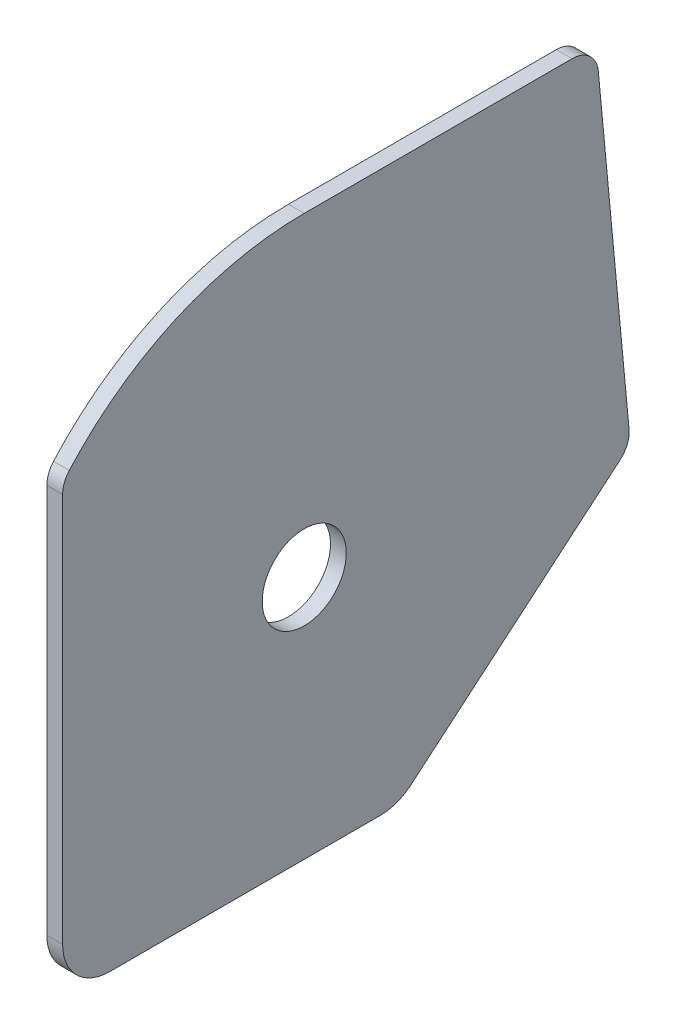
ISO-10303-21;
HEADER;
FILE_DESCRIPTION(('STEP AP214'),'2;1');
FILE_NAME('part.step','',(''),(''),'','','');
FILE_SCHEMA(('AUTOMOTIVE_DESIGN { 1 0 10303 214 1 1 1 1 }'));
ENDSEC;
DATA;
#1=APPLICATION_CONTEXT('core data for automotive mechanical design processes');
#2=APPLICATION_PROTOCOL_DEFINITION('international standard','automotive_design',2000,#1);
#3=PRODUCT_CONTEXT('',#1,'mechanical');
#4=PRODUCT('Part','Part','',(#3));
#5=PRODUCT_RELATED_PRODUCT_CATEGORY('part','',(#4));
#6=PRODUCT_DEFINITION_FORMATION('','',#4);
#7=PRODUCT_DEFINITION_CONTEXT('part definition',#1,'design');
#8=PRODUCT_DEFINITION('design','',#6,#7);
#9=PRODUCT_DEFINITION_SHAPE('','',#8);
#10=(LENGTH_UNIT() NAMED_UNIT(*) SI_UNIT(.MILLI.,.METRE.));
#11=(NAMED_UNIT(*) PLANE_ANGLE_UNIT() SI_UNIT($,.RADIAN.));
#12=(NAMED_UNIT(*) SI_UNIT($,.STERADIAN.) SOLID_ANGLE_UNIT());
#13=UNCERTAINTY_MEASURE_WITH_UNIT(LENGTH_MEASURE(1.E-05),#10,'distance_accuracy_value','');
#14=(GEOMETRIC_REPRESENTATION_CONTEXT(3) GLOBAL_UNCERTAINTY_ASSIGNED_CONTEXT((#13)) GLOBAL_UNIT_ASSIGNED_CONTEXT((#10,
#11,#12)) REPRESENTATION_CONTEXT('',''));
#15=CARTESIAN_POINT('',(0.,0.,0.));
#16=DIRECTION('',(0.,0.,1.));
#17=DIRECTION('',(1.,0.,0.));
#18=AXIS2_PLACEMENT_3D('',#15,#16,#17);
#19=CARTESIAN_POINT('',(3.,0.,0.));
#20=DIRECTION('',(1.,0.,0.));
#21=DIRECTION('',(0.,0.,-1.));
#22=AXIS2_PLACEMENT_3D('',#19,#20,#21);
#23=PLANE('',#22);
#24=CARTESIAN_POINT('',(3.,0.,0.));
#25=DIRECTION('',(1.,0.,0.));
#26=DIRECTION('',(0.,0.,-1.));
#27=AXIS2_PLACEMENT_3D('',#24,#25,#26);
#28=CIRCLE('',#27,60.);
#29=CARTESIAN_POINT('',(3.,60.,0.));
#30=VERTEX_POINT('',#29);
#31=CARTESIAN_POINT('',(3.,39.9933878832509,44.7272727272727));
#32=VERTEX_POINT('',#31);
#33=EDGE_CURVE('E156',#30,#32,#28,.T.);
#34=ORIENTED_EDGE('',*,*,#33,.T.);
#35=CARTESIAN_POINT('',(3.,36.6606055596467,41.));
#36=DIRECTION('',(1.,0.,0.));
#37=DIRECTION('',(0.,0.,-1.));
#38=AXIS2_PLACEMENT_3D('',#35,#36,#37);
#39=CIRCLE('',#38,4.99999999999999);
#40=CARTESIAN_POINT('',(3.,36.6606055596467,46.));
#41=VERTEX_POINT('',#40);
#42=EDGE_CURVE('E127',#32,#41,#39,.T.);
#43=ORIENTED_EDGE('',*,*,#42,.T.);
#44=DIRECTION('',(0.,-1.,0.));
#45=VECTOR('',#44,1.);
#46=CARTESIAN_POINT('',(3.,36.6606055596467,46.));
#47=LINE('',#46,#45);
#48=CARTESIAN_POINT('',(3.,-37.4999999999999,46.));
#49=VERTEX_POINT('',#48);
#50=EDGE_CURVE('E159',#41,#49,#47,.T.);
#51=ORIENTED_EDGE('',*,*,#50,.T.);
#52=CARTESIAN_POINT('',(3.,-37.5,37.));
#53=DIRECTION('',(1.,0.,0.));
#54=DIRECTION('',(0.,0.,1.));
#55=AXIS2_PLACEMENT_3D('',#52,#53,#54);
#56=CIRCLE('',#55,9.);
#57=CARTESIAN_POINT('',(3.,-46.5,36.9999999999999));
#58=VERTEX_POINT('',#57);
#59=EDGE_CURVE('E161',#49,#58,#56,.T.);
#60=ORIENTED_EDGE('',*,*,#59,.T.);
#61=DIRECTION('',(0.,0.,-1.));
#62=VECTOR('',#61,1.);
#63=CARTESIAN_POINT('',(3.,-46.5,36.9999999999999));
#64=LINE('',#63,#62);
#65=CARTESIAN_POINT('',(3.,-46.5,-14.5));
#66=VERTEX_POINT('',#65);
#67=EDGE_CURVE('E163',#58,#66,#64,.T.);
#68=ORIENTED_EDGE('',*,*,#67,.T.);
#69=CARTESIAN_POINT('',(3.,-37.5,-14.5));
#70=DIRECTION('',(1.,0.,0.));
#71=DIRECTION('',(0.,0.,1.));
#72=AXIS2_PLACEMENT_3D('',#69,#70,#71);
#73=CIRCLE('',#72,8.99999999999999);
#74=CARTESIAN_POINT('',(3.,-44.3741642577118,-20.3091191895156));
#75=VERTEX_POINT('',#74);
#76=EDGE_CURVE('E165',#66,#75,#73,.T.);
#77=ORIENTED_EDGE('',*,*,#76,.T.);
#78=DIRECTION('',(0.,0.645457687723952,-0.76379602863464));
#79=VECTOR('',#78,1.);
#80=CARTESIAN_POINT('',(3.,-44.3741642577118,-20.3091191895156));
#81=LINE('',#80,#79);
#82=CARTESIAN_POINT('',(3.,-10.7628737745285,-60.0827103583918));
#83=VERTEX_POINT('',#82);
#84=EDGE_CURVE('E167',#75,#83,#81,.T.);
#85=ORIENTED_EDGE('',*,*,#84,.T.);
#86=CARTESIAN_POINT('',(3.,-6.94389363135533,-56.855421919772));
#87=DIRECTION('',(1.,0.,0.));
#88=DIRECTION('',(0.,0.,-1.));
#89=AXIS2_PLACEMENT_3D('',#86,#87,#88);
#90=CIRCLE('',#89,5.);
#91=CARTESIAN_POINT('',(3.,-6.47335206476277,-61.8332317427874));
#92=VERTEX_POINT('',#91);
#93=EDGE_CURVE('E169',#83,#92,#90,.T.);
#94=ORIENTED_EDGE('',*,*,#93,.T.);
#95=DIRECTION('',(0.,0.99556196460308,0.0941083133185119));
#96=VECTOR('',#95,1.);
#97=CARTESIAN_POINT('',(3.,-6.47335206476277,-61.8332317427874));
#98=LINE('',#97,#96);
#99=CARTESIAN_POINT('',(3.,55.4705415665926,-55.9778098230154));
#100=VERTEX_POINT('',#99);
#101=EDGE_CURVE('E171',#92,#100,#98,.T.);
#102=ORIENTED_EDGE('',*,*,#101,.T.);
#103=CARTESIAN_POINT('',(3.,55.,-51.));
#104=DIRECTION('',(1.,0.,0.));
#105=DIRECTION('',(0.,0.,-1.));
#106=AXIS2_PLACEMENT_3D('',#103,#104,#105);
#107=CIRCLE('',#106,5.);
#108=CARTESIAN_POINT('',(3.,60.,-51.));
#109=VERTEX_POINT('',#108);
#110=EDGE_CURVE('E50',#100,#109,#107,.T.);
#111=ORIENTED_EDGE('',*,*,#110,.T.);
#112=DIRECTION('',(0.,0.,1.));
#113=VECTOR('',#112,1.);
#114=CARTESIAN_POINT('',(3.,60.,-51.));
#115=LINE('',#114,#113);
#116=EDGE_CURVE('E45',#109,#30,#115,.T.);
#117=ORIENTED_EDGE('',*,*,#116,.T.);
#118=EDGE_LOOP('',(#34,#43,#51,#60,#68,#77,#85,#94,#102,#111,#117));
#119=FACE_BOUND('',#118,.T.);
#120=CARTESIAN_POINT('',(3.,0.,0.));
#121=DIRECTION('',(1.,0.,0.));
#122=DIRECTION('',(0.,0.,-1.));
#123=AXIS2_PLACEMENT_3D('',#120,#121,#122);
#124=CIRCLE('',#123,8.);
#125=CARTESIAN_POINT('',(3.,0.,-8.));
#126=VERTEX_POINT('',#125);
#127=EDGE_CURVE('E132',#126,#126,#124,.T.);
#128=ORIENTED_EDGE('',*,*,#127,.F.);
#129=EDGE_LOOP('',(#128));
#130=FACE_BOUND('',#129,.T.);
#131=ADVANCED_FACE('F30',(#119,#130),#23,.T.);
#132=CARTESIAN_POINT('',(0.,0.,0.));
#133=DIRECTION('',(1.,0.,0.));
#134=DIRECTION('',(0.,0.,-1.));
#135=AXIS2_PLACEMENT_3D('',#132,#133,#134);
#136=PLANE('',#135);
#137=CARTESIAN_POINT('',(0.,0.,0.));
#138=DIRECTION('',(1.,0.,0.));
#139=DIRECTION('',(0.,0.,-1.));
#140=AXIS2_PLACEMENT_3D('',#137,#138,#139);
#141=CIRCLE('',#140,60.);
#142=CARTESIAN_POINT('',(0.,60.,0.));
#143=VERTEX_POINT('',#142);
#144=CARTESIAN_POINT('',(0.,39.9933878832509,44.7272727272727));
#145=VERTEX_POINT('',#144);
#146=EDGE_CURVE('E118',#143,#145,#141,.T.);
#147=ORIENTED_EDGE('',*,*,#146,.F.);
#148=DIRECTION('',(0.,0.,1.));
#149=VECTOR('',#148,1.);
#150=CARTESIAN_POINT('',(0.,60.,-51.));
#151=LINE('',#150,#149);
#152=CARTESIAN_POINT('',(0.,60.,-51.));
#153=VERTEX_POINT('',#152);
#154=EDGE_CURVE('E154',#153,#143,#151,.T.);
#155=ORIENTED_EDGE('',*,*,#154,.F.);
#156=CARTESIAN_POINT('',(0.,55.,-51.));
#157=DIRECTION('',(1.,0.,0.));
#158=DIRECTION('',(0.,0.,-1.));
#159=AXIS2_PLACEMENT_3D('',#156,#157,#158);
#160=CIRCLE('',#159,5.);
#161=CARTESIAN_POINT('',(0.,55.4705415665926,-55.9778098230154));
#162=VERTEX_POINT('',#161);
#163=EDGE_CURVE('E152',#162,#153,#160,.T.);
#164=ORIENTED_EDGE('',*,*,#163,.F.);
#165=DIRECTION('',(0.,0.99556196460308,0.0941083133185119));
#166=VECTOR('',#165,1.);
#167=CARTESIAN_POINT('',(0.,-6.47335206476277,-61.8332317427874));
#168=LINE('',#167,#166);
#169=CARTESIAN_POINT('',(0.,-6.47335206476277,-61.8332317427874));
#170=VERTEX_POINT('',#169);
#171=EDGE_CURVE('E150',#170,#162,#168,.T.);
#172=ORIENTED_EDGE('',*,*,#171,.F.);
#173=CARTESIAN_POINT('',(0.,-6.94389363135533,-56.855421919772));
#174=DIRECTION('',(1.,0.,0.));
#175=DIRECTION('',(0.,0.,-1.));
#176=AXIS2_PLACEMENT_3D('',#173,#174,#175);
#177=CIRCLE('',#176,5.);
#178=CARTESIAN_POINT('',(0.,-10.7628737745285,-60.0827103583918));
#179=VERTEX_POINT('',#178);
#180=EDGE_CURVE('E148',#179,#170,#177,.T.);
#181=ORIENTED_EDGE('',*,*,#180,.F.);
#182=DIRECTION('',(0.,0.645457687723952,-0.76379602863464));
#183=VECTOR('',#182,1.);
#184=CARTESIAN_POINT('',(0.,-44.3741642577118,-20.3091191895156));
#185=LINE('',#184,#183);
#186=CARTESIAN_POINT('',(0.,-44.3741642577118,-20.3091191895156));
#187=VERTEX_POINT('',#186);
#188=EDGE_CURVE('E146',#187,#179,#185,.T.);
#189=ORIENTED_EDGE('',*,*,#188,.F.);
#190=CARTESIAN_POINT('',(0.,-37.5,-14.5));
#191=DIRECTION('',(1.,0.,0.));
#192=DIRECTION('',(0.,0.,1.));
#193=AXIS2_PLACEMENT_3D('',#190,#191,#192);
#194=CIRCLE('',#193,8.99999999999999);
#195=CARTESIAN_POINT('',(0.,-46.5,-14.5));
#196=VERTEX_POINT('',#195);
#197=EDGE_CURVE('E144',#196,#187,#194,.T.);
#198=ORIENTED_EDGE('',*,*,#197,.F.);
#199=DIRECTION('',(0.,0.,-1.));
#200=VECTOR('',#199,1.);
#201=CARTESIAN_POINT('',(0.,-46.5,36.9999999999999));
#202=LINE('',#201,#200);
#203=CARTESIAN_POINT('',(0.,-46.5,36.9999999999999));
#204=VERTEX_POINT('',#203);
#205=EDGE_CURVE('E142',#204,#196,#202,.T.);
#206=ORIENTED_EDGE('',*,*,#205,.F.);
#207=CARTESIAN_POINT('',(0.,-37.5,37.));
#208=DIRECTION('',(1.,0.,0.));
#209=DIRECTION('',(0.,0.,1.));
#210=AXIS2_PLACEMENT_3D('',#207,#208,#209);
#211=CIRCLE('',#210,9.);
#212=CARTESIAN_POINT('',(0.,-37.4999999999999,46.));
#213=VERTEX_POINT('',#212);
#214=EDGE_CURVE('E140',#213,#204,#211,.T.);
#215=ORIENTED_EDGE('',*,*,#214,.F.);
#216=DIRECTION('',(0.,-1.,0.));
#217=VECTOR('',#216,1.);
#218=CARTESIAN_POINT('',(0.,36.6606055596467,46.));
#219=LINE('',#218,#217);
#220=CARTESIAN_POINT('',(0.,36.6606055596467,46.));
#221=VERTEX_POINT('',#220);
#222=EDGE_CURVE('E120',#221,#213,#219,.T.);
#223=ORIENTED_EDGE('',*,*,#222,.F.);
#224=CARTESIAN_POINT('',(0.,36.6606055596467,41.));
#225=DIRECTION('',(1.,0.,0.));
#226=DIRECTION('',(0.,0.,-1.));
#227=AXIS2_PLACEMENT_3D('',#224,#225,#226);
#228=CIRCLE('',#227,4.99999999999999);
#229=EDGE_CURVE('E113',#145,#221,#228,.T.);
#230=ORIENTED_EDGE('',*,*,#229,.F.);
#231=EDGE_LOOP('',(#147,#155,#164,#172,#181,#189,#198,#206,#215,#223,#230));
#232=FACE_BOUND('',#231,.T.);
#233=CARTESIAN_POINT('',(0.,0.,0.));
#234=DIRECTION('',(1.,0.,0.));
#235=DIRECTION('',(0.,0.,-1.));
#236=AXIS2_PLACEMENT_3D('',#233,#234,#235);
#237=CIRCLE('',#236,8.);
#238=CARTESIAN_POINT('',(0.,0.,-8.));
#239=VERTEX_POINT('',#238);
#240=EDGE_CURVE('E135',#239,#239,#237,.T.);
#241=ORIENTED_EDGE('',*,*,#240,.T.);
#242=EDGE_LOOP('',(#241));
#243=FACE_BOUND('',#242,.T.);
#244=ADVANCED_FACE('F114',(#232,#243),#136,.F.);
#245=CARTESIAN_POINT('',(3.,0.,0.));
#246=DIRECTION('',(-1.,0.,0.));
#247=DIRECTION('',(0.,0.,1.));
#248=AXIS2_PLACEMENT_3D('',#245,#246,#247);
#249=CYLINDRICAL_SURFACE('',#248,60.);
#250=ORIENTED_EDGE('',*,*,#146,.T.);
#251=DIRECTION('',(-1.,0.,0.));
#252=VECTOR('',#251,1.);
#253=CARTESIAN_POINT('',(3.,39.9933878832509,44.7272727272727));
#254=LINE('',#253,#252);
#255=EDGE_CURVE('E11',#32,#145,#254,.T.);
#256=ORIENTED_EDGE('',*,*,#255,.F.);
#257=ORIENTED_EDGE('',*,*,#33,.F.);
#258=DIRECTION('',(-1.,0.,0.));
#259=VECTOR('',#258,1.);
#260=CARTESIAN_POINT('',(3.,60.,0.));
#261=LINE('',#260,#259);
#262=EDGE_CURVE('E131',#30,#143,#261,.T.);
#263=ORIENTED_EDGE('',*,*,#262,.T.);
#264=EDGE_LOOP('',(#250,#256,#257,#263));
#265=FACE_BOUND('',#264,.T.);
#266=ADVANCED_FACE('F32',(#265),#249,.T.);
#267=CARTESIAN_POINT('',(3.,36.6606055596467,41.));
#268=DIRECTION('',(-1.,0.,0.));
#269=DIRECTION('',(0.,0.,1.));
#270=AXIS2_PLACEMENT_3D('',#267,#268,#269);
#271=CYLINDRICAL_SURFACE('',#270,4.99999999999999);
#272=ORIENTED_EDGE('',*,*,#229,.T.);
#273=DIRECTION('',(-1.,0.,0.));
#274=VECTOR('',#273,1.);
#275=CARTESIAN_POINT('',(3.,36.6606055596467,46.));
#276=LINE('',#275,#274);
#277=EDGE_CURVE('E38',#41,#221,#276,.T.);
#278=ORIENTED_EDGE('',*,*,#277,.F.);
#279=ORIENTED_EDGE('',*,*,#42,.F.);
#280=ORIENTED_EDGE('',*,*,#255,.T.);
#281=EDGE_LOOP('',(#272,#278,#279,#280));
#282=FACE_BOUND('',#281,.T.);
#283=ADVANCED_FACE('F126',(#282),#271,.T.);
#284=CARTESIAN_POINT('',(3.,36.6606055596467,46.));
#285=DIRECTION('',(0.,0.,-1.));
#286=DIRECTION('',(0.,1.,0.));
#287=AXIS2_PLACEMENT_3D('',#284,#285,#286);
#288=PLANE('',#287);
#289=ORIENTED_EDGE('',*,*,#222,.T.);
#290=DIRECTION('',(-1.,0.,0.));
#291=VECTOR('',#290,1.);
#292=CARTESIAN_POINT('',(3.,-37.4999999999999,46.));
#293=LINE('',#292,#291);
#294=EDGE_CURVE('E197',#49,#213,#293,.T.);
#295=ORIENTED_EDGE('',*,*,#294,.F.);
#296=ORIENTED_EDGE('',*,*,#50,.F.);
#297=ORIENTED_EDGE('',*,*,#277,.T.);
#298=EDGE_LOOP('',(#289,#295,#296,#297));
#299=FACE_BOUND('',#298,.T.);
#300=ADVANCED_FACE('F201',(#299),#288,.F.);
#301=CARTESIAN_POINT('',(3.,-37.5,37.));
#302=DIRECTION('',(-1.,0.,0.));
#303=DIRECTION('',(0.,0.,1.));
#304=AXIS2_PLACEMENT_3D('',#301,#302,#303);
#305=CYLINDRICAL_SURFACE('',#304,9.);
#306=ORIENTED_EDGE('',*,*,#214,.T.);
#307=DIRECTION('',(-1.,0.,0.));
#308=VECTOR('',#307,1.);
#309=CARTESIAN_POINT('',(3.,-46.5,36.9999999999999));
#310=LINE('',#309,#308);
#311=EDGE_CURVE('E194',#58,#204,#310,.T.);
#312=ORIENTED_EDGE('',*,*,#311,.F.);
#313=ORIENTED_EDGE('',*,*,#59,.F.);
#314=ORIENTED_EDGE('',*,*,#294,.T.);
#315=EDGE_LOOP('',(#306,#312,#313,#314));
#316=FACE_BOUND('',#315,.T.);
#317=ADVANCED_FACE('F209',(#316),#305,.T.);
#318=CARTESIAN_POINT('',(3.,-46.5,36.9999999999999));
#319=DIRECTION('',(0.,1.,0.));
#320=DIRECTION('',(0.,0.,1.));
#321=AXIS2_PLACEMENT_3D('',#318,#319,#320);
#322=PLANE('',#321);
#323=ORIENTED_EDGE('',*,*,#205,.T.);
#324=DIRECTION('',(-1.,0.,0.));
#325=VECTOR('',#324,1.);
#326=CARTESIAN_POINT('',(3.,-46.5,-14.5));
#327=LINE('',#326,#325);
#328=EDGE_CURVE('E191',#66,#196,#327,.T.);
#329=ORIENTED_EDGE('',*,*,#328,.F.);
#330=ORIENTED_EDGE('',*,*,#67,.F.);
#331=ORIENTED_EDGE('',*,*,#311,.T.);
#332=EDGE_LOOP('',(#323,#329,#330,#331));
#333=FACE_BOUND('',#332,.T.);
#334=ADVANCED_FACE('F212',(#333),#322,.F.);
#335=CARTESIAN_POINT('',(3.,-37.5,-14.5));
#336=DIRECTION('',(-1.,0.,0.));
#337=DIRECTION('',(0.,0.,1.));
#338=AXIS2_PLACEMENT_3D('',#335,#336,#337);
#339=CYLINDRICAL_SURFACE('',#338,8.99999999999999);
#340=ORIENTED_EDGE('',*,*,#197,.T.);
#341=DIRECTION('',(-1.,0.,0.));
#342=VECTOR('',#341,1.);
#343=CARTESIAN_POINT('',(3.,-44.3741642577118,-20.3091191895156));
#344=LINE('',#343,#342);
#345=EDGE_CURVE('E188',#75,#187,#344,.T.);
#346=ORIENTED_EDGE('',*,*,#345,.F.);
#347=ORIENTED_EDGE('',*,*,#76,.F.);
#348=ORIENTED_EDGE('',*,*,#328,.T.);
#349=EDGE_LOOP('',(#340,#346,#347,#348));
#350=FACE_BOUND('',#349,.T.);
#351=ADVANCED_FACE('F217',(#350),#339,.T.);
#352=CARTESIAN_POINT('',(3.,-44.3741642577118,-20.3091191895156));
#353=DIRECTION('',(0.,0.76379602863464,0.645457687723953));
#354=DIRECTION('',(0.,-0.645457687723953,0.763796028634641));
#355=AXIS2_PLACEMENT_3D('',#352,#353,#354);
#356=PLANE('',#355);
#357=ORIENTED_EDGE('',*,*,#188,.T.);
#358=DIRECTION('',(-1.,0.,0.));
#359=VECTOR('',#358,1.);
#360=CARTESIAN_POINT('',(3.,-10.7628737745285,-60.0827103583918));
#361=LINE('',#360,#359);
#362=EDGE_CURVE('E185',#83,#179,#361,.T.);
#363=ORIENTED_EDGE('',*,*,#362,.F.);
#364=ORIENTED_EDGE('',*,*,#84,.F.);
#365=ORIENTED_EDGE('',*,*,#345,.T.);
#366=EDGE_LOOP('',(#357,#363,#364,#365));
#367=FACE_BOUND('',#366,.T.);
#368=ADVANCED_FACE('F223',(#367),#356,.F.);
#369=CARTESIAN_POINT('',(3.,-6.94389363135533,-56.855421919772));
#370=DIRECTION('',(-1.,0.,0.));
#371=DIRECTION('',(0.,0.,1.));
#372=AXIS2_PLACEMENT_3D('',#369,#370,#371);
#373=CYLINDRICAL_SURFACE('',#372,5.);
#374=ORIENTED_EDGE('',*,*,#180,.T.);
#375=DIRECTION('',(-1.,0.,0.));
#376=VECTOR('',#375,1.);
#377=CARTESIAN_POINT('',(3.,-6.47335206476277,-61.8332317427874));
#378=LINE('',#377,#376);
#379=EDGE_CURVE('E182',#92,#170,#378,.T.);
#380=ORIENTED_EDGE('',*,*,#379,.F.);
#381=ORIENTED_EDGE('',*,*,#93,.F.);
#382=ORIENTED_EDGE('',*,*,#362,.T.);
#383=EDGE_LOOP('',(#374,#380,#381,#382));
#384=FACE_BOUND('',#383,.T.);
#385=ADVANCED_FACE('F227',(#384),#373,.T.);
#386=CARTESIAN_POINT('',(3.,-6.47335206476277,-61.8332317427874));
#387=DIRECTION('',(0.,-0.0941083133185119,0.99556196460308));
#388=DIRECTION('',(0.,-0.99556196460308,-0.0941083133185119));
#389=AXIS2_PLACEMENT_3D('',#386,#387,#388);
#390=PLANE('',#389);
#391=ORIENTED_EDGE('',*,*,#171,.T.);
#392=DIRECTION('',(-1.,0.,0.));
#393=VECTOR('',#392,1.);
#394=CARTESIAN_POINT('',(3.,55.4705415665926,-55.9778098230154));
#395=LINE('',#394,#393);
#396=EDGE_CURVE('E179',#100,#162,#395,.T.);
#397=ORIENTED_EDGE('',*,*,#396,.F.);
#398=ORIENTED_EDGE('',*,*,#101,.F.);
#399=ORIENTED_EDGE('',*,*,#379,.T.);
#400=EDGE_LOOP('',(#391,#397,#398,#399));
#401=FACE_BOUND('',#400,.T.);
#402=ADVANCED_FACE('F232',(#401),#390,.F.);
#403=CARTESIAN_POINT('',(3.,55.,-51.));
#404=DIRECTION('',(-1.,0.,0.));
#405=DIRECTION('',(0.,0.,1.));
#406=AXIS2_PLACEMENT_3D('',#403,#404,#405);
#407=CYLINDRICAL_SURFACE('',#406,5.);
#408=ORIENTED_EDGE('',*,*,#163,.T.);
#409=DIRECTION('',(-1.,0.,0.));
#410=VECTOR('',#409,1.);
#411=CARTESIAN_POINT('',(3.,60.,-51.));
#412=LINE('',#411,#410);
#413=EDGE_CURVE('E176',#109,#153,#412,.T.);
#414=ORIENTED_EDGE('',*,*,#413,.F.);
#415=ORIENTED_EDGE('',*,*,#110,.F.);
#416=ORIENTED_EDGE('',*,*,#396,.T.);
#417=EDGE_LOOP('',(#408,#414,#415,#416));
#418=FACE_BOUND('',#417,.T.);
#419=ADVANCED_FACE('F235',(#418),#407,.T.);
#420=CARTESIAN_POINT('',(3.,60.,-51.));
#421=DIRECTION('',(0.,-1.,0.));
#422=DIRECTION('',(0.,0.,-1.));
#423=AXIS2_PLACEMENT_3D('',#420,#421,#422);
#424=PLANE('',#423);
#425=ORIENTED_EDGE('',*,*,#154,.T.);
#426=ORIENTED_EDGE('',*,*,#262,.F.);
#427=ORIENTED_EDGE('',*,*,#116,.F.);
#428=ORIENTED_EDGE('',*,*,#413,.T.);
#429=EDGE_LOOP('',(#425,#426,#427,#428));
#430=FACE_BOUND('',#429,.T.);
#431=ADVANCED_FACE('F237',(#430),#424,.F.);
#432=CARTESIAN_POINT('',(3.,0.,0.));
#433=DIRECTION('',(-1.,0.,0.));
#434=DIRECTION('',(0.,0.,1.));
#435=AXIS2_PLACEMENT_3D('',#432,#433,#434);
#436=CYLINDRICAL_SURFACE('',#435,8.);
#437=ORIENTED_EDGE('',*,*,#127,.T.);
#438=EDGE_LOOP('',(#437));
#439=FACE_BOUND('',#438,.T.);
#440=ORIENTED_EDGE('',*,*,#240,.F.);
#441=EDGE_LOOP('',(#440));
#442=FACE_BOUND('',#441,.T.);
#443=ADVANCED_FACE('F239',(#439,#442),#436,.F.);
#444=CLOSED_SHELL('',(#131,#244,#266,#283,#300,#317,#334,#351,#368,#385,#402,#419,#431,#443));
#445=MANIFOLD_SOLID_BREP('B2',#444);
#446=ADVANCED_BREP_SHAPE_REPRESENTATION('',(#18,#445),#14);
#447=SHAPE_DEFINITION_REPRESENTATION(#9,#446);
ENDSEC;
END-ISO-10303-21;
